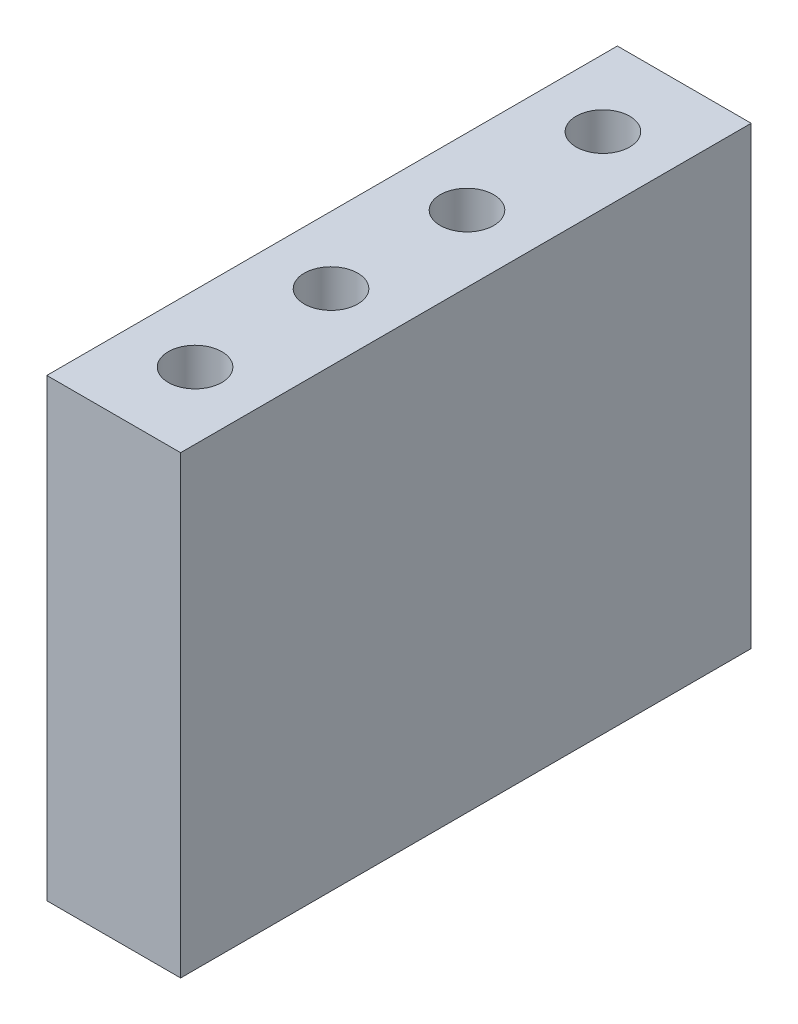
from build123d import *

# Parameters (mm, degrees)
SKETCH1_W          = 2.5
SKETCH1_H          = 10.660000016
EXTRUDE1_DEPTH     = 8.5
SKETCH2_R          = 0.5
CUT_EXTRUDE1_DEPTH = 6.38


with BuildPart() as part:
    # Sketch1 → Extrude1 (new body)
    with BuildSketch(Plane(origin=(0, 0, 0), x_dir=(1, 0, 0), z_dir=(0, 1, 0))):
        with Locations((1.25, 5.330000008)):
            Rectangle(SKETCH1_W, SKETCH1_H)
    extrude(amount=EXTRUDE1_DEPTH)

    # Sketch2 → Cut-Extrude1 (cut)
    with BuildSketch(Plane(origin=(0, 8.5, 0), x_dir=(-1, 0, 0), z_dir=(0, 1, 0))):
        with Locations(Location((-1.25, -4.060000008, 0), (0, 0, 90))):
            Circle(SKETCH2_R)
        with Locations(Location((-1.25, -1.520000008, 0), (0, 0, 90))):
            Circle(SKETCH2_R)
        with Locations(Location((-1.25, -9.140000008, 0), (0, 0, 270))):
            Circle(SKETCH2_R)
        with Locations(Location((-1.25, -6.600000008, 0), (0, 0, 270))):
            Circle(SKETCH2_R)
    extrude(amount=-CUT_EXTRUDE1_DEPTH, mode=Mode.SUBTRACT)


solid = part.part
